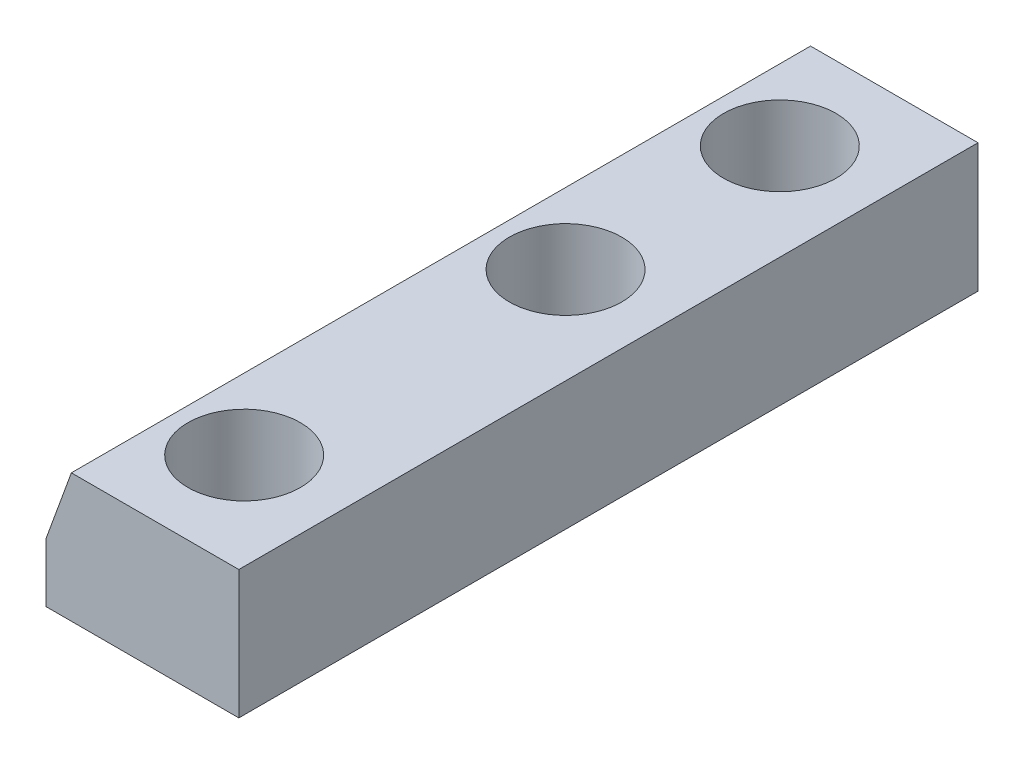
from build123d import *

# Parameters (mm, degrees)
BOSS_EXTRU_1_DEPTH                = 69
DIAM_TRE_DU_PER_AGE_10_5_10_5_1_D = 10.5


with BuildPart() as part:
    # Esquisse1 → Boss.-Extru.1 (new body)
    with BuildSketch(Plane(origin=(0, 0, -34.5), x_dir=(-1, 0, 0), z_dir=(0, 0, -1))):
        Polygon((-4.367642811, 12), (-20, 12), (-20, 0), (-2, 0), (-2, 5.494954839), align=None)
    extrude(amount=-BOSS_EXTRU_1_DEPTH)

    # Diam_tre du per_age _10.5 _10.5_1 (through all)
    with Locations(Plane(origin=(0, 0, 0), x_dir=(-1, 0, 0), z_dir=(0, -1, 0))):
        with Locations((-11, 25), (-11, 5), (-11, -25)):
            Hole(DIAM_TRE_DU_PER_AGE_10_5_10_5_1_D / 2)


solid = part.part
